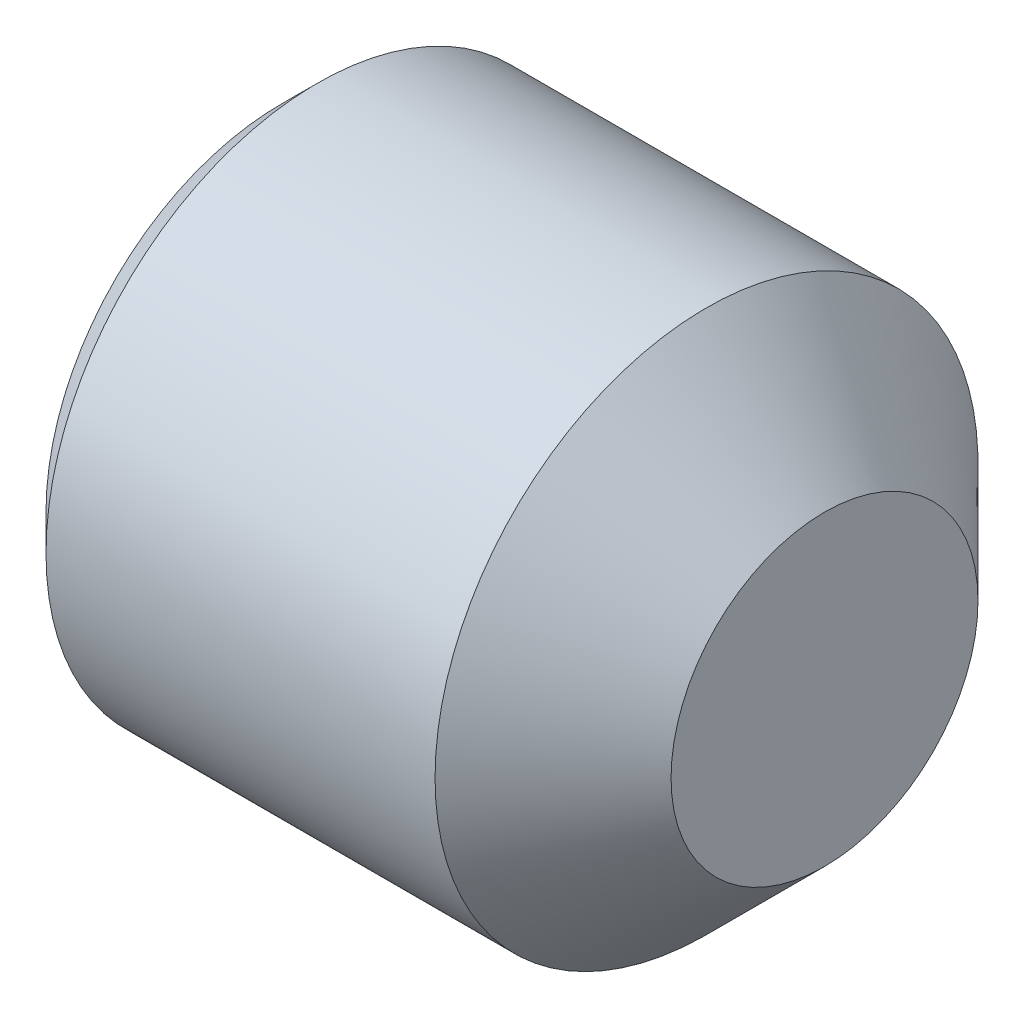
ISO-10303-21;
HEADER;
FILE_DESCRIPTION(('STEP AP214'),'2;1');
FILE_NAME('part.step','',(''),(''),'','','');
FILE_SCHEMA(('AUTOMOTIVE_DESIGN { 1 0 10303 214 1 1 1 1 }'));
ENDSEC;
DATA;
#1=APPLICATION_CONTEXT('core data for automotive mechanical design processes');
#2=APPLICATION_PROTOCOL_DEFINITION('international standard','automotive_design',2000,#1);
#3=PRODUCT_CONTEXT('',#1,'mechanical');
#4=PRODUCT('Part','Part','',(#3));
#5=PRODUCT_RELATED_PRODUCT_CATEGORY('part','',(#4));
#6=PRODUCT_DEFINITION_FORMATION('','',#4);
#7=PRODUCT_DEFINITION_CONTEXT('part definition',#1,'design');
#8=PRODUCT_DEFINITION('design','',#6,#7);
#9=PRODUCT_DEFINITION_SHAPE('','',#8);
#10=(LENGTH_UNIT() NAMED_UNIT(*) SI_UNIT(.MILLI.,.METRE.));
#11=(NAMED_UNIT(*) PLANE_ANGLE_UNIT() SI_UNIT($,.RADIAN.));
#12=(NAMED_UNIT(*) SI_UNIT($,.STERADIAN.) SOLID_ANGLE_UNIT());
#13=UNCERTAINTY_MEASURE_WITH_UNIT(LENGTH_MEASURE(1.E-05),#10,'distance_accuracy_value','');
#14=(GEOMETRIC_REPRESENTATION_CONTEXT(3) GLOBAL_UNCERTAINTY_ASSIGNED_CONTEXT((#13)) GLOBAL_UNIT_ASSIGNED_CONTEXT((#10,
#11,#12)) REPRESENTATION_CONTEXT('',''));
#15=CARTESIAN_POINT('',(0.,0.,0.));
#16=DIRECTION('',(0.,0.,1.));
#17=DIRECTION('',(1.,0.,0.));
#18=AXIS2_PLACEMENT_3D('',#15,#16,#17);
#19=CARTESIAN_POINT('',(0.,0.,0.));
#20=DIRECTION('',(-1.,0.,0.));
#21=DIRECTION('',(0.,0.,0.999999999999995));
#22=AXIS2_PLACEMENT_3D('',#19,#20,#21);
#23=PLANE('',#22);
#24=CARTESIAN_POINT('',(0.,0.,0.));
#25=DIRECTION('',(-1.,0.,0.));
#26=DIRECTION('',(0.,0.,0.999999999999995));
#27=AXIS2_PLACEMENT_3D('',#24,#25,#26);
#28=CIRCLE('',#27,4.13258);
#29=CARTESIAN_POINT('',(0.,0.,4.13257999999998));
#30=VERTEX_POINT('',#29);
#31=EDGE_CURVE('E140',#30,#30,#28,.T.);
#32=ORIENTED_EDGE('',*,*,#31,.T.);
#33=EDGE_LOOP('',(#32));
#34=FACE_BOUND('',#33,.T.);
#35=DIRECTION('',(0.,0.,-0.999999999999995));
#36=VECTOR('',#35,1.);
#37=CARTESIAN_POINT('',(0.,2.38125000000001,1.3748153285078));
#38=LINE('',#37,#36);
#39=CARTESIAN_POINT('',(0.,2.38125000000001,1.3748153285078));
#40=VERTEX_POINT('',#39);
#41=CARTESIAN_POINT('',(0.,2.38125,-1.37481532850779));
#42=VERTEX_POINT('',#41);
#43=EDGE_CURVE('E131',#40,#42,#38,.T.);
#44=ORIENTED_EDGE('',*,*,#43,.F.);
#45=DIRECTION('',(0.,-0.866025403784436,0.499999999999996));
#46=VECTOR('',#45,1.);
#47=CARTESIAN_POINT('',(0.,2.38125000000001,1.3748153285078));
#48=LINE('',#47,#46);
#49=CARTESIAN_POINT('',(0.,0.,2.74963065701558));
#50=VERTEX_POINT('',#49);
#51=EDGE_CURVE('E53',#40,#50,#48,.T.);
#52=ORIENTED_EDGE('',*,*,#51,.T.);
#53=DIRECTION('',(0.,0.866025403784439,0.5));
#54=VECTOR('',#53,1.);
#55=CARTESIAN_POINT('',(0.,-2.38124999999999,1.37481532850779));
#56=LINE('',#55,#54);
#57=CARTESIAN_POINT('',(0.,-2.38124999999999,1.37481532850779));
#58=VERTEX_POINT('',#57);
#59=EDGE_CURVE('E122',#58,#50,#56,.T.);
#60=ORIENTED_EDGE('',*,*,#59,.F.);
#61=DIRECTION('',(0.,0.,-0.999999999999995));
#62=VECTOR('',#61,1.);
#63=CARTESIAN_POINT('',(0.,-2.38124999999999,1.37481532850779));
#64=LINE('',#63,#62);
#65=CARTESIAN_POINT('',(0.,-2.38124999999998,-1.37481532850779));
#66=VERTEX_POINT('',#65);
#67=EDGE_CURVE('E125',#58,#66,#64,.T.);
#68=ORIENTED_EDGE('',*,*,#67,.T.);
#69=DIRECTION('',(0.,0.866025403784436,-0.499999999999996));
#70=VECTOR('',#69,1.);
#71=CARTESIAN_POINT('',(0.,-2.38124999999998,-1.37481532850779));
#72=LINE('',#71,#70);
#73=CARTESIAN_POINT('',(0.,0.,-2.74963065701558));
#74=VERTEX_POINT('',#73);
#75=EDGE_CURVE('E128',#66,#74,#72,.T.);
#76=ORIENTED_EDGE('',*,*,#75,.T.);
#77=DIRECTION('',(0.,-0.866025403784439,-0.5));
#78=VECTOR('',#77,1.);
#79=CARTESIAN_POINT('',(0.,2.38125,-1.37481532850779));
#80=LINE('',#79,#78);
#81=EDGE_CURVE('E111',#42,#74,#80,.T.);
#82=ORIENTED_EDGE('',*,*,#81,.F.);
#83=EDGE_LOOP('',(#44,#52,#60,#68,#76,#82));
#84=FACE_BOUND('',#83,.T.);
#85=ADVANCED_FACE('F38',(#34,#84),#23,.T.);
#86=CARTESIAN_POINT('',(9.52500000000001,2.69240000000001,0.));
#87=DIRECTION('',(1.,0.,0.));
#88=DIRECTION('',(0.,0.,-0.999999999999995));
#89=AXIS2_PLACEMENT_3D('',#86,#87,#88);
#90=PLANE('',#89);
#91=CARTESIAN_POINT('',(9.52500000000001,0.,0.));
#92=DIRECTION('',(-1.,0.,0.));
#93=DIRECTION('',(0.,0.,0.999999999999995));
#94=AXIS2_PLACEMENT_3D('',#91,#92,#93);
#95=CIRCLE('',#94,2.6924);
#96=CARTESIAN_POINT('',(9.52500000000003,0.,2.69240000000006));
#97=VERTEX_POINT('',#96);
#98=EDGE_CURVE('E11',#97,#97,#95,.T.);
#99=ORIENTED_EDGE('',*,*,#98,.F.);
#100=EDGE_LOOP('',(#99));
#101=FACE_BOUND('',#100,.T.);
#102=ADVANCED_FACE('F40',(#101),#90,.T.);
#103=CARTESIAN_POINT('',(7.45490000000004,0.,0.));
#104=DIRECTION('',(-1.,0.,0.));
#105=DIRECTION('',(0.,0.,0.999999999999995));
#106=AXIS2_PLACEMENT_3D('',#103,#104,#105);
#107=CONICAL_SURFACE('',#106,4.7625,0.78539816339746);
#108=ORIENTED_EDGE('',*,*,#98,.T.);
#109=EDGE_LOOP('',(#108));
#110=FACE_BOUND('',#109,.T.);
#111=CARTESIAN_POINT('',(7.45490000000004,0.,0.));
#112=DIRECTION('',(-1.,0.,0.));
#113=DIRECTION('',(0.,0.,0.999999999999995));
#114=AXIS2_PLACEMENT_3D('',#111,#112,#113);
#115=CIRCLE('',#114,4.7625);
#116=CARTESIAN_POINT('',(7.45490000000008,0.,4.76250000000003));
#117=VERTEX_POINT('',#116);
#118=EDGE_CURVE('E46',#117,#117,#115,.T.);
#119=ORIENTED_EDGE('',*,*,#118,.F.);
#120=EDGE_LOOP('',(#119));
#121=FACE_BOUND('',#120,.T.);
#122=ADVANCED_FACE('F151',(#110,#121),#107,.T.);
#123=CARTESIAN_POINT('',(-12.7,0.,0.));
#124=DIRECTION('',(-1.,0.,0.));
#125=DIRECTION('',(0.,0.,0.999999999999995));
#126=AXIS2_PLACEMENT_3D('',#123,#124,#125);
#127=CYLINDRICAL_SURFACE('',#126,4.7625);
#128=ORIENTED_EDGE('',*,*,#118,.T.);
#129=EDGE_LOOP('',(#128));
#130=FACE_BOUND('',#129,.T.);
#131=CARTESIAN_POINT('',(0.629920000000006,0.,0.));
#132=DIRECTION('',(-1.,0.,0.));
#133=DIRECTION('',(0.,0.,0.999999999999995));
#134=AXIS2_PLACEMENT_3D('',#131,#132,#133);
#135=CIRCLE('',#134,4.7625);
#136=CARTESIAN_POINT('',(0.629920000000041,0.,4.76249999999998));
#137=VERTEX_POINT('',#136);
#138=EDGE_CURVE('E143',#137,#137,#135,.T.);
#139=ORIENTED_EDGE('',*,*,#138,.F.);
#140=EDGE_LOOP('',(#139));
#141=FACE_BOUND('',#140,.T.);
#142=ADVANCED_FACE('F148',(#130,#141),#127,.T.);
#143=CARTESIAN_POINT('',(0.,0.,0.));
#144=DIRECTION('',(1.,0.,0.));
#145=DIRECTION('',(0.,0.,-0.999999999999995));
#146=AXIS2_PLACEMENT_3D('',#143,#144,#145);
#147=CONICAL_SURFACE('',#146,4.13258,0.785398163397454);
#148=ORIENTED_EDGE('',*,*,#138,.T.);
#149=EDGE_LOOP('',(#148));
#150=FACE_BOUND('',#149,.T.);
#151=ORIENTED_EDGE('',*,*,#31,.F.);
#152=EDGE_LOOP('',(#151));
#153=FACE_BOUND('',#152,.T.);
#154=ADVANCED_FACE('F158',(#150,#153),#147,.T.);
#155=CARTESIAN_POINT('',(4.77520000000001,2.38125000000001,1.37481532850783));
#156=DIRECTION('',(0.,-0.500000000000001,-0.866025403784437));
#157=DIRECTION('',(0.,0.866025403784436,-0.499999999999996));
#158=AXIS2_PLACEMENT_3D('',#155,#156,#157);
#159=PLANE('',#158);
#160=ORIENTED_EDGE('',*,*,#51,.F.);
#161=DIRECTION('',(-1.,0.,0.));
#162=VECTOR('',#161,1.);
#163=CARTESIAN_POINT('',(4.77520000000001,2.38125000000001,1.37481532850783));
#164=LINE('',#163,#162);
#165=CARTESIAN_POINT('',(4.77520000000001,2.38125000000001,1.37481532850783));
#166=VERTEX_POINT('',#165);
#167=EDGE_CURVE('E58',#166,#40,#164,.T.);
#168=ORIENTED_EDGE('',*,*,#167,.F.);
#169=DIRECTION('',(0.,-0.866025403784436,0.499999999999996));
#170=VECTOR('',#169,1.);
#171=CARTESIAN_POINT('',(4.77520000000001,2.38125000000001,1.37481532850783));
#172=LINE('',#171,#170);
#173=CARTESIAN_POINT('',(4.77520000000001,0.,2.74963065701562));
#174=VERTEX_POINT('',#173);
#175=EDGE_CURVE('E85',#166,#174,#172,.T.);
#176=ORIENTED_EDGE('',*,*,#175,.T.);
#177=DIRECTION('',(-1.,0.,0.));
#178=VECTOR('',#177,1.);
#179=CARTESIAN_POINT('',(4.77520000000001,0.,2.74963065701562));
#180=LINE('',#179,#178);
#181=EDGE_CURVE('E138',#174,#50,#180,.T.);
#182=ORIENTED_EDGE('',*,*,#181,.T.);
#183=EDGE_LOOP('',(#160,#168,#176,#182));
#184=FACE_BOUND('',#183,.T.);
#185=ADVANCED_FACE('F169',(#184),#159,.T.);
#186=CARTESIAN_POINT('',(4.77520000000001,-2.38124999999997,1.37481532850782));
#187=DIRECTION('',(0.,-0.499999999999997,0.866025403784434));
#188=DIRECTION('',(0.,-0.866025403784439,-0.5));
#189=AXIS2_PLACEMENT_3D('',#186,#187,#188);
#190=PLANE('',#189);
#191=ORIENTED_EDGE('',*,*,#59,.T.);
#192=ORIENTED_EDGE('',*,*,#181,.F.);
#193=DIRECTION('',(0.,0.866025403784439,0.5));
#194=VECTOR('',#193,1.);
#195=CARTESIAN_POINT('',(4.77520000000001,-2.38124999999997,1.37481532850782));
#196=LINE('',#195,#194);
#197=CARTESIAN_POINT('',(4.77520000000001,-2.38124999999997,1.37481532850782));
#198=VERTEX_POINT('',#197);
#199=EDGE_CURVE('E269',#198,#174,#196,.T.);
#200=ORIENTED_EDGE('',*,*,#199,.F.);
#201=DIRECTION('',(-1.,0.,0.));
#202=VECTOR('',#201,1.);
#203=CARTESIAN_POINT('',(4.77520000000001,-2.38124999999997,1.37481532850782));
#204=LINE('',#203,#202);
#205=EDGE_CURVE('E136',#198,#58,#204,.T.);
#206=ORIENTED_EDGE('',*,*,#205,.T.);
#207=EDGE_LOOP('',(#191,#192,#200,#206));
#208=FACE_BOUND('',#207,.T.);
#209=ADVANCED_FACE('F176',(#208),#190,.F.);
#210=CARTESIAN_POINT('',(4.77520000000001,-2.38124999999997,1.37481532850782));
#211=DIRECTION('',(0.,0.999999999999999,0.));
#212=DIRECTION('',(0.,0.,0.999999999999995));
#213=AXIS2_PLACEMENT_3D('',#210,#211,#212);
#214=PLANE('',#213);
#215=ORIENTED_EDGE('',*,*,#67,.F.);
#216=ORIENTED_EDGE('',*,*,#205,.F.);
#217=DIRECTION('',(0.,0.,-0.999999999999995));
#218=VECTOR('',#217,1.);
#219=CARTESIAN_POINT('',(4.77520000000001,-2.38124999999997,1.37481532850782));
#220=LINE('',#219,#218);
#221=CARTESIAN_POINT('',(4.77519999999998,-2.38124999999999,-1.37481532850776));
#222=VERTEX_POINT('',#221);
#223=EDGE_CURVE('E106',#198,#222,#220,.T.);
#224=ORIENTED_EDGE('',*,*,#223,.T.);
#225=DIRECTION('',(-1.,0.,0.));
#226=VECTOR('',#225,1.);
#227=CARTESIAN_POINT('',(4.77519999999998,-2.38124999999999,-1.37481532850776));
#228=LINE('',#227,#226);
#229=EDGE_CURVE('E101',#222,#66,#228,.T.);
#230=ORIENTED_EDGE('',*,*,#229,.T.);
#231=EDGE_LOOP('',(#215,#216,#224,#230));
#232=FACE_BOUND('',#231,.T.);
#233=ADVANCED_FACE('F183',(#232),#214,.T.);
#234=CARTESIAN_POINT('',(4.77519999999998,-2.38124999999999,-1.37481532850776));
#235=DIRECTION('',(0.,0.500000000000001,0.866025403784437));
#236=DIRECTION('',(0.,-0.866025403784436,0.499999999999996));
#237=AXIS2_PLACEMENT_3D('',#234,#235,#236);
#238=PLANE('',#237);
#239=ORIENTED_EDGE('',*,*,#75,.F.);
#240=ORIENTED_EDGE('',*,*,#229,.F.);
#241=DIRECTION('',(0.,0.866025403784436,-0.499999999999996));
#242=VECTOR('',#241,1.);
#243=CARTESIAN_POINT('',(4.77519999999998,-2.38124999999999,-1.37481532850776));
#244=LINE('',#243,#242);
#245=CARTESIAN_POINT('',(4.77519999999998,0.,-2.74963065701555));
#246=VERTEX_POINT('',#245);
#247=EDGE_CURVE('E96',#222,#246,#244,.T.);
#248=ORIENTED_EDGE('',*,*,#247,.T.);
#249=DIRECTION('',(-1.,0.,0.));
#250=VECTOR('',#249,1.);
#251=CARTESIAN_POINT('',(4.77519999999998,0.,-2.74963065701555));
#252=LINE('',#251,#250);
#253=EDGE_CURVE('E100',#246,#74,#252,.T.);
#254=ORIENTED_EDGE('',*,*,#253,.T.);
#255=EDGE_LOOP('',(#239,#240,#248,#254));
#256=FACE_BOUND('',#255,.T.);
#257=ADVANCED_FACE('F99',(#256),#238,.T.);
#258=CARTESIAN_POINT('',(4.77520000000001,2.38125000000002,-1.37481532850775));
#259=DIRECTION('',(0.,0.499999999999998,-0.866025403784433));
#260=DIRECTION('',(0.,0.866025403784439,0.5));
#261=AXIS2_PLACEMENT_3D('',#258,#259,#260);
#262=PLANE('',#261);
#263=ORIENTED_EDGE('',*,*,#81,.T.);
#264=ORIENTED_EDGE('',*,*,#253,.F.);
#265=DIRECTION('',(0.,-0.866025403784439,-0.5));
#266=VECTOR('',#265,1.);
#267=CARTESIAN_POINT('',(4.77520000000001,2.38125000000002,-1.37481532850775));
#268=LINE('',#267,#266);
#269=CARTESIAN_POINT('',(4.77520000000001,2.38125000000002,-1.37481532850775));
#270=VERTEX_POINT('',#269);
#271=EDGE_CURVE('E105',#270,#246,#268,.T.);
#272=ORIENTED_EDGE('',*,*,#271,.F.);
#273=DIRECTION('',(-1.,0.,0.));
#274=VECTOR('',#273,1.);
#275=CARTESIAN_POINT('',(4.77520000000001,2.38125000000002,-1.37481532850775));
#276=LINE('',#275,#274);
#277=EDGE_CURVE('E81',#270,#42,#276,.T.);
#278=ORIENTED_EDGE('',*,*,#277,.T.);
#279=EDGE_LOOP('',(#263,#264,#272,#278));
#280=FACE_BOUND('',#279,.T.);
#281=ADVANCED_FACE('F108',(#280),#262,.F.);
#282=CARTESIAN_POINT('',(4.77520000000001,2.38125000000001,1.37481532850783));
#283=DIRECTION('',(0.,0.999999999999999,0.));
#284=DIRECTION('',(0.,0.,0.999999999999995));
#285=AXIS2_PLACEMENT_3D('',#282,#283,#284);
#286=PLANE('',#285);
#287=ORIENTED_EDGE('',*,*,#43,.T.);
#288=ORIENTED_EDGE('',*,*,#277,.F.);
#289=DIRECTION('',(0.,0.,-0.999999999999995));
#290=VECTOR('',#289,1.);
#291=CARTESIAN_POINT('',(4.77520000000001,2.38125000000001,1.37481532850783));
#292=LINE('',#291,#290);
#293=EDGE_CURVE('E116',#166,#270,#292,.T.);
#294=ORIENTED_EDGE('',*,*,#293,.F.);
#295=ORIENTED_EDGE('',*,*,#167,.T.);
#296=EDGE_LOOP('',(#287,#288,#294,#295));
#297=FACE_BOUND('',#296,.T.);
#298=ADVANCED_FACE('F195',(#297),#286,.F.);
#299=CARTESIAN_POINT('',(4.77520000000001,4.7625,0.));
#300=DIRECTION('',(1.,0.,0.));
#301=DIRECTION('',(0.,0.,-0.999999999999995));
#302=AXIS2_PLACEMENT_3D('',#299,#300,#301);
#303=PLANE('',#302);
#304=ORIENTED_EDGE('',*,*,#175,.F.);
#305=ORIENTED_EDGE('',*,*,#293,.T.);
#306=ORIENTED_EDGE('',*,*,#271,.T.);
#307=ORIENTED_EDGE('',*,*,#247,.F.);
#308=ORIENTED_EDGE('',*,*,#223,.F.);
#309=ORIENTED_EDGE('',*,*,#199,.T.);
#310=EDGE_LOOP('',(#304,#305,#306,#307,#308,#309));
#311=FACE_BOUND('',#310,.T.);
#312=ADVANCED_FACE('F114',(#311),#303,.F.);
#313=CLOSED_SHELL('',(#85,#102,#122,#142,#154,#185,#209,#233,#257,#281,#298,#312));
#314=MANIFOLD_SOLID_BREP('B2',#313);
#315=ADVANCED_BREP_SHAPE_REPRESENTATION('',(#18,#314),#14);
#316=SHAPE_DEFINITION_REPRESENTATION(#9,#315);
ENDSEC;
END-ISO-10303-21;
